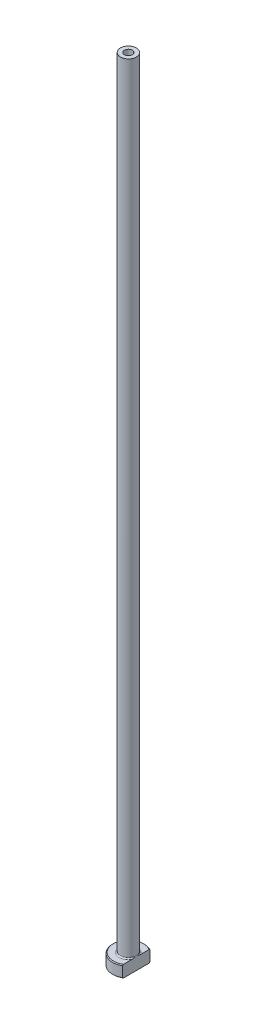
ISO-10303-21;
HEADER;
FILE_DESCRIPTION(('STEP AP214'),'2;1');
FILE_NAME('part.step','',(''),(''),'','','');
FILE_SCHEMA(('AUTOMOTIVE_DESIGN { 1 0 10303 214 1 1 1 1 }'));
ENDSEC;
DATA;
#1=APPLICATION_CONTEXT('core data for automotive mechanical design processes');
#2=APPLICATION_PROTOCOL_DEFINITION('international standard','automotive_design',2000,#1);
#3=PRODUCT_CONTEXT('',#1,'mechanical');
#4=PRODUCT('Part','Part','',(#3));
#5=PRODUCT_RELATED_PRODUCT_CATEGORY('part','',(#4));
#6=PRODUCT_DEFINITION_FORMATION('','',#4);
#7=PRODUCT_DEFINITION_CONTEXT('part definition',#1,'design');
#8=PRODUCT_DEFINITION('design','',#6,#7);
#9=PRODUCT_DEFINITION_SHAPE('','',#8);
#10=(LENGTH_UNIT() NAMED_UNIT(*) SI_UNIT(.MILLI.,.METRE.));
#11=(NAMED_UNIT(*) PLANE_ANGLE_UNIT() SI_UNIT($,.RADIAN.));
#12=(NAMED_UNIT(*) SI_UNIT($,.STERADIAN.) SOLID_ANGLE_UNIT());
#13=UNCERTAINTY_MEASURE_WITH_UNIT(LENGTH_MEASURE(1.E-05),#10,'distance_accuracy_value','');
#14=(GEOMETRIC_REPRESENTATION_CONTEXT(3) GLOBAL_UNCERTAINTY_ASSIGNED_CONTEXT((#13)) GLOBAL_UNIT_ASSIGNED_CONTEXT((#10,
#11,#12)) REPRESENTATION_CONTEXT('',''));
#15=CARTESIAN_POINT('',(0.,0.,0.));
#16=DIRECTION('',(0.,0.,1.));
#17=DIRECTION('',(1.,0.,0.));
#18=AXIS2_PLACEMENT_3D('',#15,#16,#17);
#19=CARTESIAN_POINT('',(0.,92.1876809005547,0.));
#20=DIRECTION('',(0.,1.,0.));
#21=DIRECTION('',(0.,0.,1.));
#22=AXIS2_PLACEMENT_3D('',#19,#20,#21);
#23=CYLINDRICAL_SURFACE('',#22,1.00000000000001);
#24=CARTESIAN_POINT('',(0.,200.,0.));
#25=DIRECTION('',(0.,1.,0.));
#26=DIRECTION('',(0.,0.,1.));
#27=AXIS2_PLACEMENT_3D('',#24,#25,#26);
#28=CIRCLE('',#27,1.00000000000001);
#29=CARTESIAN_POINT('',(0.,200.,1.00000000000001));
#30=VERTEX_POINT('',#29);
#31=EDGE_CURVE('E167',#30,#30,#28,.T.);
#32=ORIENTED_EDGE('',*,*,#31,.T.);
#33=EDGE_LOOP('',(#32));
#34=FACE_BOUND('',#33,.T.);
#35=CARTESIAN_POINT('',(0.,165.,0.));
#36=DIRECTION('',(0.,1.,0.));
#37=DIRECTION('',(0.,0.,1.));
#38=AXIS2_PLACEMENT_3D('',#35,#36,#37);
#39=CIRCLE('',#38,1.00000000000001);
#40=CARTESIAN_POINT('',(0.,165.,1.00000000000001));
#41=VERTEX_POINT('',#40);
#42=EDGE_CURVE('E170',#41,#41,#39,.T.);
#43=ORIENTED_EDGE('',*,*,#42,.F.);
#44=EDGE_LOOP('',(#43));
#45=FACE_BOUND('',#44,.T.);
#46=ADVANCED_FACE('F32',(#34,#45),#23,.F.);
#47=CARTESIAN_POINT('',(-1.00000000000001,200.,0.));
#48=DIRECTION('',(0.,1.,0.));
#49=DIRECTION('',(0.,0.,1.));
#50=AXIS2_PLACEMENT_3D('',#47,#48,#49);
#51=PLANE('',#50);
#52=CARTESIAN_POINT('',(0.,200.,0.));
#53=DIRECTION('',(0.,1.,0.));
#54=DIRECTION('',(0.,0.,1.));
#55=AXIS2_PLACEMENT_3D('',#52,#53,#54);
#56=CIRCLE('',#55,2.00000000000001);
#57=CARTESIAN_POINT('',(0.,200.,2.00000000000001));
#58=VERTEX_POINT('',#57);
#59=EDGE_CURVE('E174',#58,#58,#56,.T.);
#60=ORIENTED_EDGE('',*,*,#59,.T.);
#61=EDGE_LOOP('',(#60));
#62=FACE_BOUND('',#61,.T.);
#63=ORIENTED_EDGE('',*,*,#31,.F.);
#64=EDGE_LOOP('',(#63));
#65=FACE_BOUND('',#64,.T.);
#66=ADVANCED_FACE('F157',(#62,#65),#51,.T.);
#67=CARTESIAN_POINT('',(0.,92.1876809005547,0.));
#68=DIRECTION('',(0.,1.,0.));
#69=DIRECTION('',(0.,0.,1.));
#70=AXIS2_PLACEMENT_3D('',#67,#68,#69);
#71=CYLINDRICAL_SURFACE('',#70,2.);
#72=CARTESIAN_POINT('',(0.,3.3,0.));
#73=DIRECTION('',(0.,1.,0.));
#74=DIRECTION('',(0.,0.,1.));
#75=AXIS2_PLACEMENT_3D('',#72,#73,#74);
#76=CIRCLE('',#75,2.);
#77=CARTESIAN_POINT('',(2.,3.3,0.));
#78=VERTEX_POINT('',#77);
#79=EDGE_CURVE('E180',#78,#78,#76,.T.);
#80=ORIENTED_EDGE('',*,*,#79,.T.);
#81=EDGE_LOOP('',(#80));
#82=FACE_BOUND('',#81,.T.);
#83=ORIENTED_EDGE('',*,*,#59,.F.);
#84=EDGE_LOOP('',(#83));
#85=FACE_BOUND('',#84,.T.);
#86=ADVANCED_FACE('F162',(#82,#85),#71,.T.);
#87=CARTESIAN_POINT('',(-1.99999999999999,3.,0.));
#88=DIRECTION('',(0.,1.,0.));
#89=DIRECTION('',(0.,0.,1.));
#90=AXIS2_PLACEMENT_3D('',#87,#88,#89);
#91=PLANE('',#90);
#92=DIRECTION('',(0.,0.,1.));
#93=VECTOR('',#92,1.);
#94=CARTESIAN_POINT('',(2.,3.,0.));
#95=LINE('',#94,#93);
#96=CARTESIAN_POINT('',(2.,3.,-3.23109888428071));
#97=VERTEX_POINT('',#96);
#98=CARTESIAN_POINT('',(2.,3.,-1.13578166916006));
#99=VERTEX_POINT('',#98);
#100=EDGE_CURVE('E54',#97,#99,#95,.T.);
#101=ORIENTED_EDGE('',*,*,#100,.F.);
#102=CARTESIAN_POINT('',(0.,3.,0.));
#103=DIRECTION('',(0.,1.,0.));
#104=DIRECTION('',(0.,0.,1.));
#105=AXIS2_PLACEMENT_3D('',#102,#103,#104);
#106=CIRCLE('',#105,3.8);
#107=CARTESIAN_POINT('',(1.99999999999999,2.99999999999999,3.23109888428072));
#108=VERTEX_POINT('',#107);
#109=EDGE_CURVE('E186',#97,#108,#106,.T.);
#110=ORIENTED_EDGE('',*,*,#109,.T.);
#111=CARTESIAN_POINT('',(2.,3.,1.13578166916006));
#112=VERTEX_POINT('',#111);
#113=EDGE_CURVE('E134',#112,#108,#95,.T.);
#114=ORIENTED_EDGE('',*,*,#113,.F.);
#115=CARTESIAN_POINT('',(0.,3.,0.));
#116=DIRECTION('',(0.,1.,0.));
#117=DIRECTION('',(0.,0.,1.));
#118=AXIS2_PLACEMENT_3D('',#115,#116,#117);
#119=CIRCLE('',#118,2.3);
#120=EDGE_CURVE('E183',#112,#99,#119,.F.);
#121=ORIENTED_EDGE('',*,*,#120,.T.);
#122=EDGE_LOOP('',(#101,#110,#114,#121));
#123=FACE_BOUND('',#122,.T.);
#124=ADVANCED_FACE('F197',(#123),#91,.T.);
#125=CARTESIAN_POINT('',(0.,92.1876809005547,0.));
#126=DIRECTION('',(0.,1.,0.));
#127=DIRECTION('',(0.,0.,1.));
#128=AXIS2_PLACEMENT_3D('',#125,#126,#127);
#129=CYLINDRICAL_SURFACE('',#128,3.99999999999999);
#130=DIRECTION('',(0.,-1.,0.));
#131=VECTOR('',#130,1.);
#132=CARTESIAN_POINT('',(1.99999999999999,200.,3.46410161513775));
#133=LINE('',#132,#131);
#134=CARTESIAN_POINT('',(1.99999999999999,2.79999999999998,3.46410161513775));
#135=VERTEX_POINT('',#134);
#136=CARTESIAN_POINT('',(1.99999999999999,0.200000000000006,3.46410161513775));
#137=VERTEX_POINT('',#136);
#138=EDGE_CURVE('E82',#135,#137,#133,.T.);
#139=ORIENTED_EDGE('',*,*,#138,.F.);
#140=CARTESIAN_POINT('',(0.,2.79999999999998,0.));
#141=DIRECTION('',(0.,1.,0.));
#142=DIRECTION('',(0.,0.,1.));
#143=AXIS2_PLACEMENT_3D('',#140,#141,#142);
#144=CIRCLE('',#143,3.99999999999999);
#145=CARTESIAN_POINT('',(2.,2.79999999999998,-3.46410161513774));
#146=VERTEX_POINT('',#145);
#147=EDGE_CURVE('E95',#135,#146,#144,.F.);
#148=ORIENTED_EDGE('',*,*,#147,.T.);
#149=DIRECTION('',(0.,-1.,0.));
#150=VECTOR('',#149,1.);
#151=CARTESIAN_POINT('',(2.,200.,-3.46410161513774));
#152=LINE('',#151,#150);
#153=CARTESIAN_POINT('',(2.,0.200000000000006,-3.46410161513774));
#154=VERTEX_POINT('',#153);
#155=EDGE_CURVE('E192',#146,#154,#152,.T.);
#156=ORIENTED_EDGE('',*,*,#155,.T.);
#157=CARTESIAN_POINT('',(0.,0.200000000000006,0.));
#158=DIRECTION('',(0.,-1.,0.));
#159=DIRECTION('',(0.,0.,-1.));
#160=AXIS2_PLACEMENT_3D('',#157,#158,#159);
#161=CIRCLE('',#160,3.99999999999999);
#162=EDGE_CURVE('E98',#154,#137,#161,.F.);
#163=ORIENTED_EDGE('',*,*,#162,.T.);
#164=EDGE_LOOP('',(#139,#148,#156,#163));
#165=FACE_BOUND('',#164,.T.);
#166=ADVANCED_FACE('F190',(#165),#129,.T.);
#167=CARTESIAN_POINT('',(-3.99999999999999,0.,0.));
#168=DIRECTION('',(0.,-1.,0.));
#169=DIRECTION('',(0.,0.,-1.));
#170=AXIS2_PLACEMENT_3D('',#167,#168,#169);
#171=PLANE('',#170);
#172=CARTESIAN_POINT('',(0.,0.,0.));
#173=DIRECTION('',(0.,-1.,0.));
#174=DIRECTION('',(0.,0.,-1.));
#175=AXIS2_PLACEMENT_3D('',#172,#173,#174);
#176=CIRCLE('',#175,1.75);
#177=CARTESIAN_POINT('',(0.,0.,-1.75));
#178=VERTEX_POINT('',#177);
#179=EDGE_CURVE('E40',#178,#178,#176,.F.);
#180=ORIENTED_EDGE('',*,*,#179,.T.);
#181=EDGE_LOOP('',(#180));
#182=FACE_BOUND('',#181,.T.);
#183=DIRECTION('',(0.,0.,-1.));
#184=VECTOR('',#183,1.);
#185=CARTESIAN_POINT('',(1.99999999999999,0.,3.46410161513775));
#186=LINE('',#185,#184);
#187=CARTESIAN_POINT('',(1.99999999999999,0.,3.23109888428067));
#188=VERTEX_POINT('',#187);
#189=CARTESIAN_POINT('',(2.,0.,-3.23109888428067));
#190=VERTEX_POINT('',#189);
#191=EDGE_CURVE('E47',#188,#190,#186,.T.);
#192=ORIENTED_EDGE('',*,*,#191,.F.);
#193=CARTESIAN_POINT('',(0.,0.,0.));
#194=DIRECTION('',(0.,-1.,0.));
#195=DIRECTION('',(0.,0.,-1.));
#196=AXIS2_PLACEMENT_3D('',#193,#194,#195);
#197=CIRCLE('',#196,3.79999999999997);
#198=EDGE_CURVE('E92',#188,#190,#197,.T.);
#199=ORIENTED_EDGE('',*,*,#198,.T.);
#200=EDGE_LOOP('',(#192,#199));
#201=FACE_BOUND('',#200,.T.);
#202=ADVANCED_FACE('F91',(#182,#201),#171,.T.);
#203=CARTESIAN_POINT('',(0.,92.1876809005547,0.));
#204=DIRECTION('',(0.,1.,0.));
#205=DIRECTION('',(0.,0.,1.));
#206=AXIS2_PLACEMENT_3D('',#203,#204,#205);
#207=CYLINDRICAL_SURFACE('',#206,1.25);
#208=CARTESIAN_POINT('',(0.,0.5,0.));
#209=DIRECTION('',(0.,-1.,0.));
#210=DIRECTION('',(0.,0.,-1.));
#211=AXIS2_PLACEMENT_3D('',#208,#209,#210);
#212=CIRCLE('',#211,1.25);
#213=CARTESIAN_POINT('',(0.,0.5,-1.25));
#214=VERTEX_POINT('',#213);
#215=EDGE_CURVE('E11',#214,#214,#212,.T.);
#216=ORIENTED_EDGE('',*,*,#215,.T.);
#217=EDGE_LOOP('',(#216));
#218=FACE_BOUND('',#217,.T.);
#219=CARTESIAN_POINT('',(0.,153.,0.));
#220=DIRECTION('',(0.,1.,0.));
#221=DIRECTION('',(0.,0.,1.));
#222=AXIS2_PLACEMENT_3D('',#219,#220,#221);
#223=CIRCLE('',#222,1.25000000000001);
#224=CARTESIAN_POINT('',(0.,153.,1.25000000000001));
#225=VERTEX_POINT('',#224);
#226=EDGE_CURVE('E172',#225,#225,#223,.T.);
#227=ORIENTED_EDGE('',*,*,#226,.T.);
#228=EDGE_LOOP('',(#227));
#229=FACE_BOUND('',#228,.T.);
#230=ADVANCED_FACE('F215',(#218,#229),#207,.F.);
#231=CARTESIAN_POINT('',(0.,153.,0.));
#232=DIRECTION('',(0.,-1.,0.));
#233=DIRECTION('',(0.,0.,-1.));
#234=AXIS2_PLACEMENT_3D('',#231,#232,#233);
#235=CONICAL_SURFACE('',#234,1.25000000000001,0.0208303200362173);
#236=ORIENTED_EDGE('',*,*,#42,.T.);
#237=EDGE_LOOP('',(#236));
#238=FACE_BOUND('',#237,.T.);
#239=ORIENTED_EDGE('',*,*,#226,.F.);
#240=EDGE_LOOP('',(#239));
#241=FACE_BOUND('',#240,.T.);
#242=ADVANCED_FACE('F111',(#238,#241),#235,.F.);
#243=CARTESIAN_POINT('',(0.,3.3,0.));
#244=DIRECTION('',(0.,1.,0.));
#245=DIRECTION('',(0.,0.,1.));
#246=AXIS2_PLACEMENT_3D('',#243,#244,#245);
#247=TOROIDAL_SURFACE('',#246,2.3,0.3);
#248=ORIENTED_EDGE('',*,*,#120,.F.);
#249=CARTESIAN_POINT('',(2.,3.3,0.));
#250=CARTESIAN_POINT('',(2.,3.30000062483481,7.91120829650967E-11));
#251=CARTESIAN_POINT('',(2.,3.30000124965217,1.38467021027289E-07));
#252=CARTESIAN_POINT('',(2.,3.30000244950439,5.72507241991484E-07));
#253=CARTESIAN_POINT('',(2.,3.30000302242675,8.72849183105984E-07));
#254=CARTESIAN_POINT('',(2.,3.30000416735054,1.59335976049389E-06));
#255=CARTESIAN_POINT('',(2.,3.30000473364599,2.02244736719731E-06));
#256=CARTESIAN_POINT('',(2.,3.30000579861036,2.94494898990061E-06));
#257=CARTESIAN_POINT('',(2.,3.30000629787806,3.43770365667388E-06));
#258=CARTESIAN_POINT('',(2.,3.30000798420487,5.21460157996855E-06));
#259=CARTESIAN_POINT('',(2.,3.30000908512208,6.58181016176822E-06));
#260=CARTESIAN_POINT('',(2.,3.30001103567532,9.3977544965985E-06));
#261=CARTESIAN_POINT('',(2.,3.30001189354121,1.0841111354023E-05));
#262=CARTESIAN_POINT('',(2.,3.30001514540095,1.65122795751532E-05));
#263=CARTESIAN_POINT('',(2.,3.30001737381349,2.08398809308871E-05));
#264=CARTESIAN_POINT('',(2.,3.30002099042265,2.93440795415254E-05));
#265=CARTESIAN_POINT('',(2.,3.30002243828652,3.34960328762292E-05));
#266=CARTESIAN_POINT('',(2.,3.30002863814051,5.12890623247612E-05));
#267=CARTESIAN_POINT('',(2.,3.30003337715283,6.4925100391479E-05));
#268=CARTESIAN_POINT('',(2.,3.30004093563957,9.03829908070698E-05));
#269=CARTESIAN_POINT('',(2.,3.30004394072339,0.00010214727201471));
#270=CARTESIAN_POINT('',(1.99999999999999,3.30006787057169,0.000188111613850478));
#271=CARTESIAN_POINT('',(1.99999999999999,3.30009855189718,0.000259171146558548));
#272=CARTESIAN_POINT('',(2.,3.30021378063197,0.000536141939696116));
#273=CARTESIAN_POINT('',(2.,3.30029106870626,0.000744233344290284));
#274=CARTESIAN_POINT('',(1.99999999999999,3.30059644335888,0.00155446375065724));
#275=CARTESIAN_POINT('',(1.99999999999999,3.30083214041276,0.00215436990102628));
#276=CARTESIAN_POINT('',(2.,3.30179425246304,0.00461477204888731));
#277=CARTESIAN_POINT('',(2.,3.30251207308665,0.00647773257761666));
#278=CARTESIAN_POINT('',(1.99999999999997,3.31311632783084,0.0339840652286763));
#279=CARTESIAN_POINT('',(1.99999999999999,3.32306890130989,0.0596088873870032));
#280=CARTESIAN_POINT('',(2.,3.34248629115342,0.109946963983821));
#281=CARTESIAN_POINT('',(2.,3.35195547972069,0.134658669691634));
#282=CARTESIAN_POINT('',(1.99999999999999,3.37186796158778,0.1870465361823));
#283=CARTESIAN_POINT('',(1.99999999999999,3.38229466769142,0.2147291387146));
#284=CARTESIAN_POINT('',(2.,3.4029770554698,0.270480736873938));
#285=CARTESIAN_POINT('',(1.99999999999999,3.41322989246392,0.29855078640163));
#286=CARTESIAN_POINT('',(1.99999999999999,3.43806738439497,0.368007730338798));
#287=CARTESIAN_POINT('',(1.99999999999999,3.4524318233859,0.40947424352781));
#288=CARTESIAN_POINT('',(1.99999999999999,3.47965482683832,0.491807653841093));
#289=CARTESIAN_POINT('',(1.99999999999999,3.49254110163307,0.532665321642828));
#290=CARTESIAN_POINT('',(1.99999999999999,3.5185119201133,0.620554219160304));
#291=CARTESIAN_POINT('',(1.99999999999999,3.53137383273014,0.667652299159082));
#292=CARTESIAN_POINT('',(1.99999999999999,3.55459547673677,0.762854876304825));
#293=CARTESIAN_POINT('',(1.99999999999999,3.56493539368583,0.810964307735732));
#294=CARTESIAN_POINT('',(1.99999999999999,3.58270957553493,0.910933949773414));
#295=CARTESIAN_POINT('',(1.99999999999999,3.58991426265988,0.962836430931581));
#296=CARTESIAN_POINT('',(1.99999999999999,3.59906919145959,1.06698400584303));
#297=CARTESIAN_POINT('',(1.99999999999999,3.60103790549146,1.11922724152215));
#298=CARTESIAN_POINT('',(1.99999999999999,3.59819318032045,1.21399009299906));
#299=CARTESIAN_POINT('',(1.99999999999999,3.59455548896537,1.25653871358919));
#300=CARTESIAN_POINT('',(1.99999999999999,3.58116512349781,1.34017723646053));
#301=CARTESIAN_POINT('',(1.99999999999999,3.57150205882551,1.38127935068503));
#302=CARTESIAN_POINT('',(1.99999999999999,3.55087659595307,1.44109771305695));
#303=CARTESIAN_POINT('',(1.99999999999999,3.54291246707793,1.46084510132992));
#304=CARTESIAN_POINT('',(1.99999999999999,3.52453399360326,1.4992452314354));
#305=CARTESIAN_POINT('',(1.99999999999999,3.51411538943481,1.51789599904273));
#306=CARTESIAN_POINT('',(1.99999999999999,3.49255299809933,1.55022658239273));
#307=CARTESIAN_POINT('',(1.99999999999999,3.48185951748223,1.56420357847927));
#308=CARTESIAN_POINT('',(1.99999999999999,3.45839348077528,1.59028758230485));
#309=CARTESIAN_POINT('',(1.99999999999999,3.4456258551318,1.60239889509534));
#310=CARTESIAN_POINT('',(1.99999999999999,3.42183279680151,1.62093425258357));
#311=CARTESIAN_POINT('',(1.99999999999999,3.41131183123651,1.62800294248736));
#312=CARTESIAN_POINT('',(1.99999999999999,3.38926242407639,1.64036132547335));
#313=CARTESIAN_POINT('',(1.99999999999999,3.37773458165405,1.64565206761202));
#314=CARTESIAN_POINT('',(1.99999999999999,3.35379760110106,1.65410966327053));
#315=CARTESIAN_POINT('',(1.99999999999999,3.34138166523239,1.657257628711));
#316=CARTESIAN_POINT('',(1.99999999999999,3.31617371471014,1.66106000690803));
#317=CARTESIAN_POINT('',(1.99999999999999,3.30338200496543,1.66171638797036));
#318=CARTESIAN_POINT('',(1.99999999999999,3.27959278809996,1.66055848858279));
#319=CARTESIAN_POINT('',(1.99999999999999,3.26857876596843,1.65905512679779));
#320=CARTESIAN_POINT('',(1.99999999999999,3.24695777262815,1.65423593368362));
#321=CARTESIAN_POINT('',(1.99999999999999,3.23635086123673,1.65091983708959));
#322=CARTESIAN_POINT('',(1.99999999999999,3.21566894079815,1.64264699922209));
#323=CARTESIAN_POINT('',(1.99999999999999,3.20560117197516,1.6376723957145));
#324=CARTESIAN_POINT('',(1.99999999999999,3.18626855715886,1.62636415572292));
#325=CARTESIAN_POINT('',(1.99999999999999,3.17700400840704,1.62003001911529));
#326=CARTESIAN_POINT('',(1.99999999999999,3.15429988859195,1.60233802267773));
#327=CARTESIAN_POINT('',(1.99999999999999,3.14148777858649,1.59017362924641));
#328=CARTESIAN_POINT('',(1.99999999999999,3.11794267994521,1.56396532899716));
#329=CARTESIAN_POINT('',(1.99999999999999,3.10721625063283,1.54991572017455));
#330=CARTESIAN_POINT('',(1.99999999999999,3.08234423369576,1.51253200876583));
#331=CARTESIAN_POINT('',(1.99999999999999,3.06952968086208,1.48831711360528));
#332=CARTESIAN_POINT('',(1.99999999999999,3.04773953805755,1.43832020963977));
#333=CARTESIAN_POINT('',(1.99999999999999,3.03876197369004,1.41253901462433));
#334=CARTESIAN_POINT('',(1.99999999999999,3.01850750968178,1.34101817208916));
#335=CARTESIAN_POINT('',(1.99999999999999,3.01031623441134,1.29441496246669));
#336=CARTESIAN_POINT('',(1.99999999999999,3.00061264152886,1.1999321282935));
#337=CARTESIAN_POINT('',(1.99999999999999,2.99920833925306,1.15204398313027));
#338=CARTESIAN_POINT('',(1.99999999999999,3.00193088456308,1.04246961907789));
#339=CARTESIAN_POINT('',(1.99999999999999,3.00779200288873,0.98083624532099));
#340=CARTESIAN_POINT('',(1.99999999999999,3.02562921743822,0.858294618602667));
#341=CARTESIAN_POINT('',(1.99999999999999,3.03763032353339,0.797390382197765));
#342=CARTESIAN_POINT('',(1.99999999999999,3.06494905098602,0.681046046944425));
#343=CARTESIAN_POINT('',(1.99999999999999,3.07996031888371,0.625531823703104));
#344=CARTESIAN_POINT('',(1.99999999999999,3.11250087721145,0.515805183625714));
#345=CARTESIAN_POINT('',(1.99999999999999,3.13000629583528,0.461585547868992));
#346=CARTESIAN_POINT('',(1.99999999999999,3.15814737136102,0.379074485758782));
#347=CARTESIAN_POINT('',(1.99999999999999,3.16814918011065,0.350562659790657));
#348=CARTESIAN_POINT('',(1.99999999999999,3.18879761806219,0.292954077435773));
#349=CARTESIAN_POINT('',(1.99999999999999,3.19945417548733,0.263860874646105));
#350=CARTESIAN_POINT('',(1.99999999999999,3.21767622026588,0.214869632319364));
#351=CARTESIAN_POINT('',(2.,3.22516548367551,0.194943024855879));
#352=CARTESIAN_POINT('',(1.99999999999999,3.24017206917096,0.155327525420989));
#353=CARTESIAN_POINT('',(1.99999999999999,3.24768836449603,0.135638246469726));
#354=CARTESIAN_POINT('',(2.,3.26198776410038,0.0983447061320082));
#355=CARTESIAN_POINT('',(2.,3.26876515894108,0.0807381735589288));
#356=CARTESIAN_POINT('',(1.99999999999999,3.28263254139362,0.0448719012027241));
#357=CARTESIAN_POINT('',(1.99999999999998,3.2897245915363,0.0266128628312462));
#358=CARTESIAN_POINT('',(2.,3.29748742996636,0.0064792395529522));
#359=CARTESIAN_POINT('',(2.,3.29820461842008,0.00461774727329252));
#360=CARTESIAN_POINT('',(1.99999999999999,3.29916656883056,0.00215769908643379));
#361=CARTESIAN_POINT('',(1.99999999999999,3.29940270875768,0.00155667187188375));
#362=CARTESIAN_POINT('',(2.,3.29970861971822,0.000745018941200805));
#363=CARTESIAN_POINT('',(2.,3.29978601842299,0.000536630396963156));
#364=CARTESIAN_POINT('',(1.99999999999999,3.29990139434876,0.00025931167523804));
#365=CARTESIAN_POINT('',(1.99999999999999,3.29993209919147,0.000188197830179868));
#366=CARTESIAN_POINT('',(2.,3.2999560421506,0.000102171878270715));
#367=CARTESIAN_POINT('',(2.,3.29995904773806,9.04036024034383E-05));
#368=CARTESIAN_POINT('',(2.,3.29996660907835,6.49368827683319E-05));
#369=CARTESIAN_POINT('',(2.,3.29997135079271,5.12961180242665E-05));
#370=CARTESIAN_POINT('',(2.,3.29997755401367,3.34977880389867E-05));
#371=CARTESIAN_POINT('',(2.,3.29997900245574,2.93452210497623E-05));
#372=CARTESIAN_POINT('',(2.,3.29998262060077,2.08398594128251E-05));
#373=CARTESIAN_POINT('',(2.,3.29998485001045,1.65117318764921E-05));
#374=CARTESIAN_POINT('',(2.,3.29998810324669,1.08400648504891E-05));
#375=CARTESIAN_POINT('',(2.,3.29998896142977,9.39666028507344E-06));
#376=CARTESIAN_POINT('',(2.,3.2999909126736,6.58068293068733E-06));
#377=CARTESIAN_POINT('',(2.,3.29999201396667,5.21349248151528E-06));
#378=CARTESIAN_POINT('',(2.,3.2999937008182,3.43669393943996E-06));
#379=CARTESIAN_POINT('',(2.,3.2999942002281,2.94398282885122E-06));
#380=CARTESIAN_POINT('',(2.,3.29999526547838,2.02159382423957E-06));
#381=CARTESIAN_POINT('',(2.,3.29999583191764,1.59257560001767E-06));
#382=CARTESIAN_POINT('',(2.,3.2999969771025,8.72232615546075E-07));
#383=CARTESIAN_POINT('',(2.,3.29999755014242,5.71985224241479E-07));
#384=CARTESIAN_POINT('',(2.,3.2999987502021,1.38175092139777E-07));
#385=CARTESIAN_POINT('',(2.,3.29999937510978,-7.91185980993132E-11));
#386=CARTESIAN_POINT('',(2.,3.3,0.));
#387=B_SPLINE_CURVE_WITH_KNOTS('',3,(#249,#250,#251,#252,#253,#254,#255,#256,#257,#258,#259,
#260,#261,#262,#263,#264,#265,#266,#267,#268,#269,#270,#271,#272,#273,#274,#275,#276,#277,#278,
#279,#280,#281,#282,#283,#284,#285,#286,#287,#288,#289,#290,#291,#292,#293,#294,#295,#296,#297,
#298,#299,#300,#301,#302,#303,#304,#305,#306,#307,#308,#309,#310,#311,#312,#313,#314,#315,#316,
#317,#318,#319,#320,#321,#322,#323,#324,#325,#326,#327,#328,#329,#330,#331,#332,#333,#334,#335,
#336,#337,#338,#339,#340,#341,#342,#343,#344,#345,#346,#347,#348,#349,#350,#351,#352,#353,#354,
#355,#356,#357,#358,#359,#360,#361,#362,#363,#364,#365,#366,#367,#368,#369,#370,#371,#372,#373,
#374,#375,#376,#377,#378,#379,#380,#381,#382,#383,#384,#385,#386),.UNSPECIFIED.,.T.,.F.,(4,2,2,
2,2,2,2,2,2,2,2,2,2,2,2,2,2,2,2,2,2,2,2,2,2,2,2,2,2,2,2,2,2,2,2,2,2,2,2,2,2,2,2,2,2,2,2,2,2,2,2,
2,2,2,2,2,2,2,2,2,2,2,2,2,2,2,2,2,4),(0.,1.87392169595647E-06,3.80527254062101E-06,
5.92782004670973E-06,8.0299246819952E-06,1.32707915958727E-05,1.83039430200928E-05,
3.28629467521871E-05,4.60403056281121E-05,8.93409841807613E-05,0.000125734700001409,
0.000357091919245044,0.00102372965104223,0.00295649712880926,0.00894682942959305,
0.0914075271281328,0.170800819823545,0.259542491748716,0.349192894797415,0.480831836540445,
0.609336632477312,0.755749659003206,0.903278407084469,1.06029304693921,1.21675300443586,
1.34456674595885,1.47052354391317,1.53427785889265,1.59814364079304,1.65076980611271,
1.70327265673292,1.74115950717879,1.77902396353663,1.81721800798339,1.85538187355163,
1.88857073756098,1.92176445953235,1.95532789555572,1.9889036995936,2.04160283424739,
2.09446511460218,2.17619131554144,2.25787541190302,2.39903747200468,2.54243890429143,
2.72770087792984,2.91372355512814,3.08615579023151,3.2570365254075,3.34768022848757,
3.44062797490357,3.50449043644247,3.56771526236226,3.62431442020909,3.68307253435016,
3.68905809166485,3.69099447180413,3.69166206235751,3.69189359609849,3.6919300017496,
3.69197331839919,3.69198649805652,3.69200105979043,3.69200609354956,3.69201133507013,
3.69201343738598,3.69201556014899,3.69201749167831,3.69201936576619),.UNSPECIFIED.);
#388=EDGE_CURVE('E126',#112,#78,#387,.T.);
#389=ORIENTED_EDGE('',*,*,#388,.T.);
#390=ORIENTED_EDGE('',*,*,#79,.F.);
#391=CARTESIAN_POINT('',(2.,3.3,0.));
#392=CARTESIAN_POINT('',(2.,3.29999937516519,-7.91116646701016E-11));
#393=CARTESIAN_POINT('',(2.,3.29999875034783,-1.38467020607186E-07));
#394=CARTESIAN_POINT('',(2.,3.29999755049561,-5.72507241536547E-07));
#395=CARTESIAN_POINT('',(2.,3.29999697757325,-8.72849182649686E-07));
#396=CARTESIAN_POINT('',(2.,3.29999583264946,-1.5933597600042E-06));
#397=CARTESIAN_POINT('',(2.,3.299995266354,-2.02244736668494E-06));
#398=CARTESIAN_POINT('',(2.,3.29999420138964,-2.94494898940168E-06));
#399=CARTESIAN_POINT('',(2.,3.29999370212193,-3.43770365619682E-06));
#400=CARTESIAN_POINT('',(2.,3.29999201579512,-5.21460157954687E-06));
#401=CARTESIAN_POINT('',(2.,3.29999091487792,-6.58181016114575E-06));
#402=CARTESIAN_POINT('',(2.,3.29998896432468,-9.39775449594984E-06));
#403=CARTESIAN_POINT('',(2.,3.29998810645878,-1.08411113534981E-05));
#404=CARTESIAN_POINT('',(2.,3.29998485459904,-1.65122795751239E-05));
#405=CARTESIAN_POINT('',(2.,3.29998262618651,-2.0839880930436E-05));
#406=CARTESIAN_POINT('',(2.,3.29997900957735,-2.93440795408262E-05));
#407=CARTESIAN_POINT('',(2.,3.29997756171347,-3.34960328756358E-05));
#408=CARTESIAN_POINT('',(2.,3.29997136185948,-5.12890623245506E-05));
#409=CARTESIAN_POINT('',(2.,3.29996662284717,-6.49251003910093E-05));
#410=CARTESIAN_POINT('',(2.,3.29995906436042,-9.03829908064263E-05));
#411=CARTESIAN_POINT('',(2.,3.29995605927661,-0.000102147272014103));
#412=CARTESIAN_POINT('',(1.99999999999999,3.2999321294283,-0.000188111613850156));
#413=CARTESIAN_POINT('',(1.99999999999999,3.29990144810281,-0.000259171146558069));
#414=CARTESIAN_POINT('',(2.,3.29978621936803,-0.000536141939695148));
#415=CARTESIAN_POINT('',(2.,3.29970893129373,-0.000744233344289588));
#416=CARTESIAN_POINT('',(1.99999999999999,3.29940355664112,-0.00155446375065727));
#417=CARTESIAN_POINT('',(1.99999999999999,3.29916785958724,-0.00215436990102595));
#418=CARTESIAN_POINT('',(2.,3.29820574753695,-0.004614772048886));
#419=CARTESIAN_POINT('',(2.,3.29748792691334,-0.00647773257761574));
#420=CARTESIAN_POINT('',(1.99999999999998,3.28688367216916,-0.0339840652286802));
#421=CARTESIAN_POINT('',(1.99999999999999,3.2769310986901,-0.0596088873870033));
#422=CARTESIAN_POINT('',(2.,3.25751370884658,-0.109946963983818));
#423=CARTESIAN_POINT('',(2.,3.2480445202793,-0.134658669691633));
#424=CARTESIAN_POINT('',(1.99999999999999,3.22813203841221,-0.187046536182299));
#425=CARTESIAN_POINT('',(1.99999999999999,3.21770533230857,-0.214729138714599));
#426=CARTESIAN_POINT('',(2.,3.1970229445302,-0.270480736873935));
#427=CARTESIAN_POINT('',(1.99999999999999,3.18677010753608,-0.298550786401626));
#428=CARTESIAN_POINT('',(1.99999999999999,3.16193261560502,-0.368007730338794));
#429=CARTESIAN_POINT('',(1.99999999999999,3.14756817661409,-0.409474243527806));
#430=CARTESIAN_POINT('',(1.99999999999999,3.12034517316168,-0.49180765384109));
#431=CARTESIAN_POINT('',(1.99999999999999,3.10745889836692,-0.532665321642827));
#432=CARTESIAN_POINT('',(1.99999999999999,3.08148807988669,-0.620554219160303));
#433=CARTESIAN_POINT('',(1.99999999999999,3.06862616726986,-0.667652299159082));
#434=CARTESIAN_POINT('',(1.99999999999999,3.04540452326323,-0.762854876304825));
#435=CARTESIAN_POINT('',(1.99999999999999,3.03506460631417,-0.810964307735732));
#436=CARTESIAN_POINT('',(1.99999999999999,3.01729042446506,-0.910933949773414));
#437=CARTESIAN_POINT('',(1.99999999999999,3.01008573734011,-0.962836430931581));
#438=CARTESIAN_POINT('',(1.99999999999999,3.00093080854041,-1.06698400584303));
#439=CARTESIAN_POINT('',(1.99999999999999,2.99896209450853,-1.11922724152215));
#440=CARTESIAN_POINT('',(1.99999999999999,3.00180681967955,-1.21399009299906));
#441=CARTESIAN_POINT('',(1.99999999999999,3.00544451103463,-1.25653871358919));
#442=CARTESIAN_POINT('',(1.99999999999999,3.01883487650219,-1.34017723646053));
#443=CARTESIAN_POINT('',(1.99999999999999,3.02849794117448,-1.38127935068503));
#444=CARTESIAN_POINT('',(1.99999999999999,3.04912340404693,-1.44109771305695));
#445=CARTESIAN_POINT('',(1.99999999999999,3.05708753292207,-1.46084510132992));
#446=CARTESIAN_POINT('',(1.99999999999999,3.07546600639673,-1.4992452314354));
#447=CARTESIAN_POINT('',(1.99999999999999,3.08588461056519,-1.51789599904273));
#448=CARTESIAN_POINT('',(1.99999999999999,3.10744700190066,-1.55022658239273));
#449=CARTESIAN_POINT('',(1.99999999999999,3.11814048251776,-1.56420357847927));
#450=CARTESIAN_POINT('',(1.99999999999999,3.14160651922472,-1.59028758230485));
#451=CARTESIAN_POINT('',(1.99999999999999,3.1543741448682,-1.60239889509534));
#452=CARTESIAN_POINT('',(1.99999999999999,3.17816720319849,-1.62093425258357));
#453=CARTESIAN_POINT('',(1.99999999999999,3.18868816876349,-1.62800294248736));
#454=CARTESIAN_POINT('',(1.99999999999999,3.2107375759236,-1.64036132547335));
#455=CARTESIAN_POINT('',(1.99999999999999,3.22226541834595,-1.64565206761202));
#456=CARTESIAN_POINT('',(1.99999999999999,3.24620239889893,-1.65410966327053));
#457=CARTESIAN_POINT('',(1.99999999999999,3.2586183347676,-1.657257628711));
#458=CARTESIAN_POINT('',(1.99999999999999,3.28382628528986,-1.66106000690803));
#459=CARTESIAN_POINT('',(1.99999999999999,3.29661799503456,-1.66171638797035));
#460=CARTESIAN_POINT('',(1.99999999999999,3.32040721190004,-1.66055848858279));
#461=CARTESIAN_POINT('',(1.99999999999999,3.33142123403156,-1.65905512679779));
#462=CARTESIAN_POINT('',(1.99999999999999,3.35304222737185,-1.65423593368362));
#463=CARTESIAN_POINT('',(1.99999999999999,3.36364913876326,-1.65091983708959));
#464=CARTESIAN_POINT('',(1.99999999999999,3.38433105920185,-1.64264699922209));
#465=CARTESIAN_POINT('',(1.99999999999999,3.39439882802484,-1.6376723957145));
#466=CARTESIAN_POINT('',(1.99999999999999,3.41373144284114,-1.62636415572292));
#467=CARTESIAN_POINT('',(1.99999999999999,3.42299599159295,-1.62003001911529));
#468=CARTESIAN_POINT('',(1.99999999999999,3.44570011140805,-1.60233802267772));
#469=CARTESIAN_POINT('',(1.99999999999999,3.4585122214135,-1.59017362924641));
#470=CARTESIAN_POINT('',(1.99999999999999,3.48205732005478,-1.56396532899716));
#471=CARTESIAN_POINT('',(1.99999999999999,3.49278374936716,-1.54991572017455));
#472=CARTESIAN_POINT('',(1.99999999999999,3.51765576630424,-1.51253200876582));
#473=CARTESIAN_POINT('',(1.99999999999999,3.53047031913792,-1.48831711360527));
#474=CARTESIAN_POINT('',(1.99999999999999,3.55226046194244,-1.43832020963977));
#475=CARTESIAN_POINT('',(1.99999999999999,3.56123802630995,-1.41253901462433));
#476=CARTESIAN_POINT('',(1.99999999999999,3.58149249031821,-1.34101817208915));
#477=CARTESIAN_POINT('',(1.99999999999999,3.58968376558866,-1.29441496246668));
#478=CARTESIAN_POINT('',(1.99999999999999,3.59938735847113,-1.1999321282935));
#479=CARTESIAN_POINT('',(1.99999999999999,3.60079166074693,-1.15204398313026));
#480=CARTESIAN_POINT('',(1.99999999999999,3.59806911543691,-1.04246961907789));
#481=CARTESIAN_POINT('',(1.99999999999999,3.59220799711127,-0.980836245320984));
#482=CARTESIAN_POINT('',(1.99999999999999,3.57437078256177,-0.858294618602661));
#483=CARTESIAN_POINT('',(1.99999999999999,3.5623696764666,-0.797390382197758));
#484=CARTESIAN_POINT('',(1.99999999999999,3.53505094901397,-0.681046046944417));
#485=CARTESIAN_POINT('',(1.99999999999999,3.52003968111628,-0.625531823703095));
#486=CARTESIAN_POINT('',(1.99999999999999,3.48749912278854,-0.515805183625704));
#487=CARTESIAN_POINT('',(1.99999999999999,3.46999370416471,-0.461585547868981));
#488=CARTESIAN_POINT('',(1.99999999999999,3.44185262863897,-0.379074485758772));
#489=CARTESIAN_POINT('',(1.99999999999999,3.43185081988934,-0.350562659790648));
#490=CARTESIAN_POINT('',(1.99999999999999,3.41120238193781,-0.292954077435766));
#491=CARTESIAN_POINT('',(1.99999999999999,3.40054582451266,-0.263860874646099));
#492=CARTESIAN_POINT('',(1.99999999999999,3.38232377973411,-0.21486963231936));
#493=CARTESIAN_POINT('',(2.,3.37483451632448,-0.194943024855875));
#494=CARTESIAN_POINT('',(1.99999999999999,3.35982793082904,-0.155327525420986));
#495=CARTESIAN_POINT('',(1.99999999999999,3.35231163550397,-0.135638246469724));
#496=CARTESIAN_POINT('',(2.,3.33801223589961,-0.0983447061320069));
#497=CARTESIAN_POINT('',(2.,3.33123484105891,-0.0807381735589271));
#498=CARTESIAN_POINT('',(1.99999999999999,3.31736745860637,-0.0448719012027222));
#499=CARTESIAN_POINT('',(1.99999999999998,3.31027540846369,-0.0266128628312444));
#500=CARTESIAN_POINT('',(2.,3.30251257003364,-0.00647923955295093));
#501=CARTESIAN_POINT('',(2.,3.30179538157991,-0.0046177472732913));
#502=CARTESIAN_POINT('',(1.99999999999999,3.30083343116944,-0.00215769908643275));
#503=CARTESIAN_POINT('',(1.99999999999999,3.30059729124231,-0.00155667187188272));
#504=CARTESIAN_POINT('',(2.,3.30029138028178,-0.000745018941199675));
#505=CARTESIAN_POINT('',(2.,3.30021398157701,-0.000536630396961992));
#506=CARTESIAN_POINT('',(1.99999999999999,3.30009860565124,-0.000259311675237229));
#507=CARTESIAN_POINT('',(1.99999999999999,3.30006790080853,-0.000188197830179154));
#508=CARTESIAN_POINT('',(2.,3.3000439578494,-0.000102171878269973));
#509=CARTESIAN_POINT('',(2.,3.30004095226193,-9.04036024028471E-05));
#510=CARTESIAN_POINT('',(2.,3.30003339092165,-6.4936882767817E-05));
#511=CARTESIAN_POINT('',(2.,3.30002864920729,-5.12961180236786E-05));
#512=CARTESIAN_POINT('',(2.,3.30002244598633,-3.34977880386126E-05));
#513=CARTESIAN_POINT('',(2.,3.30002099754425,-2.93452210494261E-05));
#514=CARTESIAN_POINT('',(2.,3.30001737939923,-2.08398594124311E-05));
#515=CARTESIAN_POINT('',(2.,3.30001514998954,-1.65117318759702E-05));
#516=CARTESIAN_POINT('',(2.,3.3000118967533,-1.08400648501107E-05));
#517=CARTESIAN_POINT('',(2.,3.30001103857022,-9.39666028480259E-06));
#518=CARTESIAN_POINT('',(2.,3.3000090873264,-6.58068293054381E-06));
#519=CARTESIAN_POINT('',(2.,3.30000798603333,-5.21349248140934E-06));
#520=CARTESIAN_POINT('',(2.,3.30000629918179,-3.43669393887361E-06));
#521=CARTESIAN_POINT('',(2.,3.3000057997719,-2.94398282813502E-06));
#522=CARTESIAN_POINT('',(2.,3.30000473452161,-2.02159382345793E-06));
#523=CARTESIAN_POINT('',(2.,3.30000416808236,-1.59257559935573E-06));
#524=CARTESIAN_POINT('',(2.,3.30000302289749,-8.7223261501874E-07));
#525=CARTESIAN_POINT('',(2.,3.30000244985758,-5.71985223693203E-07));
#526=CARTESIAN_POINT('',(2.,3.30000124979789,-1.38175091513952E-07));
#527=CARTESIAN_POINT('',(2.,3.30000062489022,7.911918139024E-11));
#528=CARTESIAN_POINT('',(2.,3.3,0.));
#529=B_SPLINE_CURVE_WITH_KNOTS('',3,(#391,#392,#393,#394,#395,#396,#397,#398,#399,#400,#401,
#402,#403,#404,#405,#406,#407,#408,#409,#410,#411,#412,#413,#414,#415,#416,#417,#418,#419,#420,
#421,#422,#423,#424,#425,#426,#427,#428,#429,#430,#431,#432,#433,#434,#435,#436,#437,#438,#439,
#440,#441,#442,#443,#444,#445,#446,#447,#448,#449,#450,#451,#452,#453,#454,#455,#456,#457,#458,
#459,#460,#461,#462,#463,#464,#465,#466,#467,#468,#469,#470,#471,#472,#473,#474,#475,#476,#477,
#478,#479,#480,#481,#482,#483,#484,#485,#486,#487,#488,#489,#490,#491,#492,#493,#494,#495,#496,
#497,#498,#499,#500,#501,#502,#503,#504,#505,#506,#507,#508,#509,#510,#511,#512,#513,#514,#515,
#516,#517,#518,#519,#520,#521,#522,#523,#524,#525,#526,#527,#528),.UNSPECIFIED.,.T.,.F.,(4,2,2,
2,2,2,2,2,2,2,2,2,2,2,2,2,2,2,2,2,2,2,2,2,2,2,2,2,2,2,2,2,2,2,2,2,2,2,2,2,2,2,2,2,2,2,2,2,2,2,2,
2,2,2,2,2,2,2,2,2,2,2,2,2,2,2,2,2,4),(0.,1.87392169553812E-06,3.80527254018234E-06,
5.92782004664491E-06,8.02992468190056E-06,1.3270791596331E-05,1.83039430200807E-05,
3.28629467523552E-05,4.60403056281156E-05,8.93409841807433E-05,0.000125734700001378,
0.000357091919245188,0.00102372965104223,0.00295649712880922,0.00894682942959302,
0.0914075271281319,0.170800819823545,0.259542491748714,0.34919289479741,0.480831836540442,
0.609336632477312,0.755749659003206,0.90327840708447,1.06029304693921,1.21675300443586,
1.34456674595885,1.47052354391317,1.53427785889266,1.59814364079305,1.65076980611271,
1.70327265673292,1.74115950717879,1.77902396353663,1.81721800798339,1.85538187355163,
1.88857073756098,1.92176445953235,1.95532789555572,1.9889036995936,2.04160283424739,
2.09446511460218,2.17619131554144,2.25787541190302,2.39903747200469,2.54243890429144,
2.72770087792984,2.91372355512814,3.08615579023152,3.25703652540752,3.34768022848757,
3.44062797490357,3.50449043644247,3.56771526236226,3.62431442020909,3.68307253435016,
3.68905809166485,3.69099447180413,3.69166206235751,3.69189359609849,3.6919300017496,
3.69197331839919,3.69198649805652,3.69200105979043,3.69200609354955,3.69201133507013,
3.69201343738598,3.69201556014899,3.69201749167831,3.69201936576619),.UNSPECIFIED.);
#530=EDGE_CURVE('E135',#78,#99,#529,.T.);
#531=ORIENTED_EDGE('',*,*,#530,.T.);
#532=EDGE_LOOP('',(#248,#389,#390,#531));
#533=FACE_BOUND('',#532,.T.);
#534=ADVANCED_FACE('F141',(#533),#247,.F.);
#535=CARTESIAN_POINT('',(0.,3.,0.));
#536=DIRECTION('',(0.,-1.,0.));
#537=DIRECTION('',(0.,0.,-1.));
#538=AXIS2_PLACEMENT_3D('',#535,#536,#537);
#539=CONICAL_SURFACE('',#538,3.8,0.785398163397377);
#540=CARTESIAN_POINT('',(2.,-1.08095467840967,-7.62295524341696));
#541=CARTESIAN_POINT('',(2.,-0.913887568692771,-7.45022392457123));
#542=CARTESIAN_POINT('',(2.,-0.746999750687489,-7.27731861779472));
#543=CARTESIAN_POINT('',(2.,-0.413688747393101,-6.93105655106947));
#544=CARTESIAN_POINT('',(2.,-0.247265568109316,-6.75769978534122));
#545=CARTESIAN_POINT('',(2.,0.0850908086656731,-6.41034692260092));
#546=CARTESIAN_POINT('',(2.,0.251023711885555,-6.2363505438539));
#547=CARTESIAN_POINT('',(2.,0.582155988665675,-5.88766284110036));
#548=CARTESIAN_POINT('',(2.,0.74735536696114,-5.71297152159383));
#549=CARTESIAN_POINT('',(2.,1.07353855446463,-5.36616839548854));
#550=CARTESIAN_POINT('',(2.,1.23454099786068,-5.19407412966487));
#551=CARTESIAN_POINT('',(2.,1.55534102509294,-4.84876663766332));
#552=CARTESIAN_POINT('',(2.,1.71513861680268,-4.67555341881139));
#553=CARTESIAN_POINT('',(2.,2.03306183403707,-4.32766569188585));
#554=CARTESIAN_POINT('',(2.,2.19118781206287,-4.15299150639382));
#555=CARTESIAN_POINT('',(2.,2.50513944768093,-3.80159134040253));
#556=CARTESIAN_POINT('',(2.,2.66096519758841,-3.62486544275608));
#557=CARTESIAN_POINT('',(2.,2.90974646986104,-3.33722425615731));
#558=CARTESIAN_POINT('',(2.,3.00376148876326,-3.22722645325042));
#559=CARTESIAN_POINT('',(2.,3.19011825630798,-3.00579987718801));
#560=CARTESIAN_POINT('',(2.,3.28245983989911,-2.89437096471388));
#561=CARTESIAN_POINT('',(2.,3.46586188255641,-2.66849662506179));
#562=CARTESIAN_POINT('',(2.,3.55689849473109,-2.55403176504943));
#563=CARTESIAN_POINT('',(2.,3.7357880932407,-2.32266819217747));
#564=CARTESIAN_POINT('',(2.,3.82364184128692,-2.20577007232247));
#565=CARTESIAN_POINT('',(2.,3.9961275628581,-1.96688707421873));
#566=CARTESIAN_POINT('',(1.99999999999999,4.08069035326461,-1.84485190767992));
#567=CARTESIAN_POINT('',(1.99999999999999,4.24300264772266,-1.59599329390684));
#568=CARTESIAN_POINT('',(1.99999999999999,4.32074277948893,-1.46916359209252));
#569=CARTESIAN_POINT('',(1.99999999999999,4.4286976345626,-1.27510066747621));
#570=CARTESIAN_POINT('',(1.99999999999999,4.46305374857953,-1.21018943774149));
#571=CARTESIAN_POINT('',(1.99999999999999,4.52837146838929,-1.0786883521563));
#572=CARTESIAN_POINT('',(1.99999999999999,4.55933245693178,-1.01209819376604));
#573=CARTESIAN_POINT('',(1.99999999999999,4.64566860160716,-0.809894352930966));
#574=CARTESIAN_POINT('',(1.99999999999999,4.69478214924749,-0.67136024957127));
#575=CARTESIAN_POINT('',(1.99999999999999,4.74794829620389,-0.46365745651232));
#576=CARTESIAN_POINT('',(1.99999999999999,4.7620506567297,-0.397033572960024));
#577=CARTESIAN_POINT('',(1.99999999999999,4.78390371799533,-0.262728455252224));
#578=CARTESIAN_POINT('',(1.99999999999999,4.79165498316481,-0.195047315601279));
#579=CARTESIAN_POINT('',(1.99999999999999,4.80025690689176,-0.059452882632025));
#580=CARTESIAN_POINT('',(1.99999999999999,4.80112894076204,0.00845903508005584));
#581=CARTESIAN_POINT('',(1.99999999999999,4.79596585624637,0.144020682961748));
#582=CARTESIAN_POINT('',(1.99999999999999,4.78993016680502,0.211670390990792));
#583=CARTESIAN_POINT('',(1.99999999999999,4.77145363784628,0.345483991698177));
#584=CARTESIAN_POINT('',(1.99999999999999,4.7590677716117,0.411655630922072));
#585=CARTESIAN_POINT('',(1.99999999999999,4.72866360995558,0.542678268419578));
#586=CARTESIAN_POINT('',(1.99999999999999,4.71064463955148,0.607529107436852));
#587=CARTESIAN_POINT('',(1.99999999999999,4.66972939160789,0.736064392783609));
#588=CARTESIAN_POINT('',(1.99999999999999,4.64680564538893,0.799739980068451));
#589=CARTESIAN_POINT('',(1.99999999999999,4.5970014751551,0.925489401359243));
#590=CARTESIAN_POINT('',(1.99999999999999,4.57012185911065,0.987563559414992));
#591=CARTESIAN_POINT('',(1.99999999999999,4.48443518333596,1.17209020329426));
#592=CARTESIAN_POINT('',(1.99999999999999,4.42077407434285,1.29228210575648));
#593=CARTESIAN_POINT('',(1.99999999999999,4.28502644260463,1.52785770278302));
#594=CARTESIAN_POINT('',(1.99999999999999,4.21292931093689,1.64323509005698));
#595=CARTESIAN_POINT('',(1.99999999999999,4.06281517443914,1.87069387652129));
#596=CARTESIAN_POINT('',(1.99999999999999,3.98477595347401,1.98276048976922));
#597=CARTESIAN_POINT('',(1.99999999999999,3.82481971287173,2.20397837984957));
#598=CARTESIAN_POINT('',(1.99999999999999,3.74290465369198,2.31313108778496));
#599=CARTESIAN_POINT('',(1.99999999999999,3.57517222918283,2.53068545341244));
#600=CARTESIAN_POINT('',(1.99999999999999,3.48931769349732,2.63905831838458));
#601=CARTESIAN_POINT('',(1.99999999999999,3.31548151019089,2.85409686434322));
#602=CARTESIAN_POINT('',(1.99999999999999,3.22749963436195,2.96076236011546));
#603=CARTESIAN_POINT('',(1.99999999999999,3.0501503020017,3.17249211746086));
#604=CARTESIAN_POINT('',(1.99999999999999,2.96078672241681,3.27755963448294));
#605=CARTESIAN_POINT('',(1.99999999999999,2.78082366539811,3.48663191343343));
#606=CARTESIAN_POINT('',(1.99999999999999,2.69022416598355,3.59063665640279));
#607=CARTESIAN_POINT('',(1.99999999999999,2.44796733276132,3.86612439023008));
#608=CARTESIAN_POINT('',(1.99999999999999,2.29545972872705,4.03685912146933));
#609=CARTESIAN_POINT('',(1.99999999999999,1.9885807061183,4.37664803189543));
#610=CARTESIAN_POINT('',(1.99999999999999,1.83420923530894,4.54570216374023));
#611=CARTESIAN_POINT('',(1.99999999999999,1.52396102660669,4.88271638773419));
#612=CARTESIAN_POINT('',(1.99999999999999,1.3680830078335,5.05067529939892));
#613=CARTESIAN_POINT('',(1.99999999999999,1.05530513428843,5.38563883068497));
#614=CARTESIAN_POINT('',(1.99999999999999,0.898405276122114,5.55264344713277));
#615=CARTESIAN_POINT('',(1.99999999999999,0.590290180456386,5.87905385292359));
#616=CARTESIAN_POINT('',(1.99999999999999,0.43910664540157,6.03848959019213));
#617=CARTESIAN_POINT('',(1.99999999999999,0.13616436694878,6.3568145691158));
#618=CARTESIAN_POINT('',(1.99999999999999,-0.0155943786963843,6.51570380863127));
#619=CARTESIAN_POINT('',(1.99999999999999,-0.319404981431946,6.83286192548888));
#620=CARTESIAN_POINT('',(1.99999999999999,-0.471456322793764,6.99113129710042));
#621=CARTESIAN_POINT('',(1.99999999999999,-0.775939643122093,7.30730102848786));
#622=CARTESIAN_POINT('',(1.99999999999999,-0.928371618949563,7.46520139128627));
#623=CARTESIAN_POINT('',(1.99999999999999,-1.08095467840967,7.62295524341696));
#624=B_SPLINE_CURVE_WITH_KNOTS('',3,(#540,#541,#542,#543,#544,#545,#546,#547,#548,#549,#550,
#551,#552,#553,#554,#555,#556,#557,#558,#559,#560,#561,#562,#563,#564,#565,#566,#567,#568,#569,
#570,#571,#572,#573,#574,#575,#576,#577,#578,#579,#580,#581,#582,#583,#584,#585,#586,#587,#588,
#589,#590,#591,#592,#593,#594,#595,#596,#597,#598,#599,#600,#601,#602,#603,#604,#605,#606,#607,
#608,#609,#610,#611,#612,#613,#614,#615,#616,#617,#618,#619,#620,#621,#622,#623),.UNSPECIFIED.,
.F.,.F.,(4,2,2,2,2,2,2,2,2,2,2,2,2,2,2,2,2,2,2,2,2,2,2,2,2,2,2,2,2,2,2,2,2,2,2,2,2,2,2,2,2,4),
(0.,0.720921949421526,1.44185317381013,2.16315326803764,2.88444869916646,3.59144103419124,
4.2984287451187,5.00526427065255,5.71207135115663,6.14616174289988,6.58029471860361,
7.01901494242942,7.4576294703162,7.90290456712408,8.34878206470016,8.56901415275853,
8.78928621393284,9.22814472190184,9.43219512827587,9.63622739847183,9.83962544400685,
10.0430403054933,10.2447232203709,10.4464303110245,10.6492980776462,10.8521244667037,
11.2595582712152,11.6675100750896,12.0770700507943,12.4864250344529,12.9011677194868,
13.3159550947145,13.7297367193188,14.1435257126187,14.8302935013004,15.5170805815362,
16.2045145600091,16.891950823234,17.5511045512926,18.2102608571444,18.8686819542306,
19.527097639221),.UNSPECIFIED.);
#625=EDGE_CURVE('E133',#146,#97,#624,.T.);
#626=ORIENTED_EDGE('',*,*,#625,.F.);
#627=ORIENTED_EDGE('',*,*,#147,.F.);
#628=EDGE_CURVE('E118',#108,#135,#624,.T.);
#629=ORIENTED_EDGE('',*,*,#628,.F.);
#630=ORIENTED_EDGE('',*,*,#109,.F.);
#631=EDGE_LOOP('',(#626,#627,#629,#630));
#632=FACE_BOUND('',#631,.T.);
#633=ADVANCED_FACE('F145',(#632),#539,.T.);
#634=CARTESIAN_POINT('',(0.,0.200000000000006,0.));
#635=DIRECTION('',(0.,1.,0.));
#636=DIRECTION('',(0.,0.,1.));
#637=AXIS2_PLACEMENT_3D('',#634,#635,#636);
#638=CONICAL_SURFACE('',#637,3.99999999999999,0.785398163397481);
#639=CARTESIAN_POINT('',(1.99999999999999,4.08095467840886,7.62295524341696));
#640=CARTESIAN_POINT('',(1.99999999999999,3.91388756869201,7.45022392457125));
#641=CARTESIAN_POINT('',(1.99999999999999,3.74699975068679,7.27731861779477));
#642=CARTESIAN_POINT('',(1.99999999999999,3.41368874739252,6.93105655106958));
#643=CARTESIAN_POINT('',(1.99999999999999,3.2472655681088,6.75769978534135));
#644=CARTESIAN_POINT('',(1.99999999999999,2.91490919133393,6.4103469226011));
#645=CARTESIAN_POINT('',(1.99999999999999,2.7489762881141,6.23635054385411));
#646=CARTESIAN_POINT('',(1.99999999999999,2.4178440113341,5.88766284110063));
#647=CARTESIAN_POINT('',(1.99999999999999,2.2526446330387,5.71297152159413));
#648=CARTESIAN_POINT('',(1.99999999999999,1.92646144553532,5.36616839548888));
#649=CARTESIAN_POINT('',(1.99999999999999,1.76545900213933,5.19407412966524));
#650=CARTESIAN_POINT('',(1.99999999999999,1.44465897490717,4.84876663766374));
#651=CARTESIAN_POINT('',(1.99999999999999,1.28486138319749,4.67555341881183));
#652=CARTESIAN_POINT('',(1.99999999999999,0.966938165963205,4.32766569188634));
#653=CARTESIAN_POINT('',(1.99999999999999,0.808812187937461,4.15299150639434));
#654=CARTESIAN_POINT('',(1.99999999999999,0.494860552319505,3.8015913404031));
#655=CARTESIAN_POINT('',(1.99999999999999,0.339034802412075,3.62486544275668));
#656=CARTESIAN_POINT('',(1.99999999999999,0.0902535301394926,3.33722425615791));
#657=CARTESIAN_POINT('',(1.99999999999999,-0.00376148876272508,3.22722645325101));
#658=CARTESIAN_POINT('',(1.99999999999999,-0.19011825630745,3.00579987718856));
#659=CARTESIAN_POINT('',(1.99999999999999,-0.282459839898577,2.89437096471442));
#660=CARTESIAN_POINT('',(1.99999999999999,-0.46586188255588,2.66849662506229));
#661=CARTESIAN_POINT('',(1.99999999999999,-0.556898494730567,2.55403176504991));
#662=CARTESIAN_POINT('',(1.99999999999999,-0.735788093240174,2.32266819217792));
#663=CARTESIAN_POINT('',(1.99999999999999,-0.823641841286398,2.2057700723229));
#664=CARTESIAN_POINT('',(1.99999999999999,-0.996127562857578,1.96688707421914));
#665=CARTESIAN_POINT('',(1.99999999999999,-1.08069035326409,1.84485190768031));
#666=CARTESIAN_POINT('',(1.99999999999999,-1.24300264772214,1.5959932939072));
#667=CARTESIAN_POINT('',(1.99999999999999,-1.32074277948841,1.46916359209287));
#668=CARTESIAN_POINT('',(1.99999999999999,-1.4286976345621,1.27510066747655));
#669=CARTESIAN_POINT('',(1.99999999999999,-1.46305374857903,1.21018943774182));
#670=CARTESIAN_POINT('',(1.99999999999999,-1.5283714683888,1.07868835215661));
#671=CARTESIAN_POINT('',(1.99999999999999,-1.55933245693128,1.01209819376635));
#672=CARTESIAN_POINT('',(1.99999999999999,-1.64566860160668,0.80989435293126));
#673=CARTESIAN_POINT('',(1.99999999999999,-1.69478214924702,0.671360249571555));
#674=CARTESIAN_POINT('',(1.99999999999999,-1.74794829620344,0.463657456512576));
#675=CARTESIAN_POINT('',(1.99999999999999,-1.76205065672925,0.397033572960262));
#676=CARTESIAN_POINT('',(1.99999999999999,-1.7839037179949,0.262728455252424));
#677=CARTESIAN_POINT('',(1.99999999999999,-1.79165498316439,0.19504731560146));
#678=CARTESIAN_POINT('',(1.99999999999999,-1.80025690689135,0.0594528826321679));
#679=CARTESIAN_POINT('',(1.99999999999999,-1.80112894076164,-0.00845903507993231));
#680=CARTESIAN_POINT('',(1.99999999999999,-1.79596585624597,-0.144020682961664));
#681=CARTESIAN_POINT('',(1.99999999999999,-1.78993016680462,-0.211670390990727));
#682=CARTESIAN_POINT('',(1.99999999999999,-1.77145363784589,-0.345483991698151));
#683=CARTESIAN_POINT('',(1.99999999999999,-1.7590677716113,-0.411655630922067));
#684=CARTESIAN_POINT('',(1.99999999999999,-1.72866360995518,-0.542678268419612));
#685=CARTESIAN_POINT('',(1.99999999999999,-1.71064463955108,-0.607529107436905));
#686=CARTESIAN_POINT('',(1.99999999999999,-1.66972939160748,-0.736064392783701));
#687=CARTESIAN_POINT('',(1.99999999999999,-1.64680564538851,-0.799739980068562));
#688=CARTESIAN_POINT('',(1.99999999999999,-1.59700147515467,-0.925489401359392));
#689=CARTESIAN_POINT('',(1.99999999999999,-1.57012185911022,-0.98756355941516));
#690=CARTESIAN_POINT('',(1.99999999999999,-1.4844351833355,-1.17209020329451));
#691=CARTESIAN_POINT('',(1.99999999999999,-1.42077407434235,-1.29228210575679));
#692=CARTESIAN_POINT('',(1.99999999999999,-1.28502644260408,-1.52785770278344));
#693=CARTESIAN_POINT('',(2.,-1.21292931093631,-1.64323509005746));
#694=CARTESIAN_POINT('',(2.,-1.06281517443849,-1.87069387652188));
#695=CARTESIAN_POINT('',(2.,-0.984775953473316,-1.98276048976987));
#696=CARTESIAN_POINT('',(2.,-0.82481971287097,-2.20397837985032));
#697=CARTESIAN_POINT('',(2.,-0.742904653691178,-2.31313108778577));
#698=CARTESIAN_POINT('',(2.,-0.575172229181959,-2.53068545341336));
#699=CARTESIAN_POINT('',(2.,-0.489317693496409,-2.63905831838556));
#700=CARTESIAN_POINT('',(2.,-0.315481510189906,-2.8540968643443));
#701=CARTESIAN_POINT('',(2.,-0.227499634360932,-2.9607623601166));
#702=CARTESIAN_POINT('',(2.,-0.0501503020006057,-3.17249211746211));
#703=CARTESIAN_POINT('',(2.,0.0392132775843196,-3.27755963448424));
#704=CARTESIAN_POINT('',(2.,0.219176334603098,-3.48663191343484));
#705=CARTESIAN_POINT('',(2.,0.309775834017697,-3.59063665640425));
#706=CARTESIAN_POINT('',(2.,0.552032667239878,-3.86612439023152));
#707=CARTESIAN_POINT('',(2.,0.704540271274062,-4.0368591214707));
#708=CARTESIAN_POINT('',(2.,1.01141929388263,-4.37664803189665));
#709=CARTESIAN_POINT('',(2.,1.1657907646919,-4.54570216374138));
#710=CARTESIAN_POINT('',(2.,1.47603897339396,-4.8827163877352));
#711=CARTESIAN_POINT('',(2.,1.63191699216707,-5.05067529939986));
#712=CARTESIAN_POINT('',(2.,1.94469486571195,-5.38563883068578));
#713=CARTESIAN_POINT('',(2.,2.10159472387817,-5.5526434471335));
#714=CARTESIAN_POINT('',(2.,2.40970981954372,-5.8790538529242));
#715=CARTESIAN_POINT('',(2.,2.56089335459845,-6.03848959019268));
#716=CARTESIAN_POINT('',(2.,2.86383563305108,-6.35681456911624));
#717=CARTESIAN_POINT('',(2.,3.01559437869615,-6.51570380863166));
#718=CARTESIAN_POINT('',(2.,3.31940498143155,-6.83286192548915));
#719=CARTESIAN_POINT('',(2.,3.47145632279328,-6.99113129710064));
#720=CARTESIAN_POINT('',(2.,3.77593964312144,-7.30730102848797));
#721=CARTESIAN_POINT('',(2.,3.92837161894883,-7.46520139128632));
#722=CARTESIAN_POINT('',(2.,4.08095467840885,-7.62295524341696));
#723=B_SPLINE_CURVE_WITH_KNOTS('',3,(#639,#640,#641,#642,#643,#644,#645,#646,#647,#648,#649,
#650,#651,#652,#653,#654,#655,#656,#657,#658,#659,#660,#661,#662,#663,#664,#665,#666,#667,#668,
#669,#670,#671,#672,#673,#674,#675,#676,#677,#678,#679,#680,#681,#682,#683,#684,#685,#686,#687,
#688,#689,#690,#691,#692,#693,#694,#695,#696,#697,#698,#699,#700,#701,#702,#703,#704,#705,#706,
#707,#708,#709,#710,#711,#712,#713,#714,#715,#716,#717,#718,#719,#720,#721,#722),.UNSPECIFIED.,
.F.,.F.,(4,2,2,2,2,2,2,2,2,2,2,2,2,2,2,2,2,2,2,2,2,2,2,2,2,2,2,2,2,2,2,2,2,2,2,2,2,2,2,2,2,4),
(0.,0.720921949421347,1.44185317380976,2.1631532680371,2.88444869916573,3.59144103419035,
4.29842874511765,5.00526427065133,5.71207135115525,6.14616174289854,6.58029471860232,
7.01901494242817,7.45762947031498,7.90290456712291,8.34878206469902,8.56901415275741,
8.78928621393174,9.22814472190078,9.43219512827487,9.63622739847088,9.83962544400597,
10.0430403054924,10.2447232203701,10.4464303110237,10.6492980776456,10.8521244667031,
11.2595582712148,11.6675100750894,12.0770700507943,12.4864250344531,12.9011677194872,
13.3159550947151,13.7297367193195,14.1435257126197,14.830293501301,15.5170805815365,
16.2045145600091,16.8919508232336,17.5511045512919,18.2102608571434,18.8686819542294,
19.5270976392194),.UNSPECIFIED.);
#724=EDGE_CURVE('E79',#137,#188,#723,.T.);
#725=ORIENTED_EDGE('',*,*,#724,.F.);
#726=ORIENTED_EDGE('',*,*,#162,.F.);
#727=EDGE_CURVE('E87',#190,#154,#723,.T.);
#728=ORIENTED_EDGE('',*,*,#727,.F.);
#729=ORIENTED_EDGE('',*,*,#198,.F.);
#730=EDGE_LOOP('',(#725,#726,#728,#729));
#731=FACE_BOUND('',#730,.T.);
#732=ADVANCED_FACE('F94',(#731),#638,.T.);
#733=CARTESIAN_POINT('',(1.99999999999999,200.,3.46410161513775));
#734=DIRECTION('',(-1.,0.,0.));
#735=DIRECTION('',(0.,0.,1.));
#736=AXIS2_PLACEMENT_3D('',#733,#734,#735);
#737=PLANE('',#736);
#738=ORIENTED_EDGE('',*,*,#388,.F.);
#739=ORIENTED_EDGE('',*,*,#113,.T.);
#740=ORIENTED_EDGE('',*,*,#628,.T.);
#741=ORIENTED_EDGE('',*,*,#138,.T.);
#742=ORIENTED_EDGE('',*,*,#724,.T.);
#743=ORIENTED_EDGE('',*,*,#191,.T.);
#744=ORIENTED_EDGE('',*,*,#727,.T.);
#745=ORIENTED_EDGE('',*,*,#155,.F.);
#746=ORIENTED_EDGE('',*,*,#625,.T.);
#747=ORIENTED_EDGE('',*,*,#100,.T.);
#748=ORIENTED_EDGE('',*,*,#530,.F.);
#749=EDGE_LOOP('',(#738,#739,#740,#741,#742,#743,#744,#745,#746,#747,#748));
#750=FACE_BOUND('',#749,.T.);
#751=ADVANCED_FACE('F80',(#750),#737,.F.);
#752=CARTESIAN_POINT('',(0.,0.,0.));
#753=DIRECTION('',(0.,-1.,0.));
#754=DIRECTION('',(0.,0.,-1.));
#755=AXIS2_PLACEMENT_3D('',#752,#753,#754);
#756=CONICAL_SURFACE('',#755,1.75,0.78539816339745);
#757=ORIENTED_EDGE('',*,*,#215,.F.);
#758=EDGE_LOOP('',(#757));
#759=FACE_BOUND('',#758,.T.);
#760=ORIENTED_EDGE('',*,*,#179,.F.);
#761=EDGE_LOOP('',(#760));
#762=FACE_BOUND('',#761,.T.);
#763=ADVANCED_FACE('F34',(#759,#762),#756,.F.);
#764=CLOSED_SHELL('',(#46,#66,#86,#124,#166,#202,#230,#242,#534,#633,#732,#751,#763));
#765=MANIFOLD_SOLID_BREP('B2',#764);
#766=ADVANCED_BREP_SHAPE_REPRESENTATION('',(#18,#765),#14);
#767=SHAPE_DEFINITION_REPRESENTATION(#9,#766);
ENDSEC;
END-ISO-10303-21;
